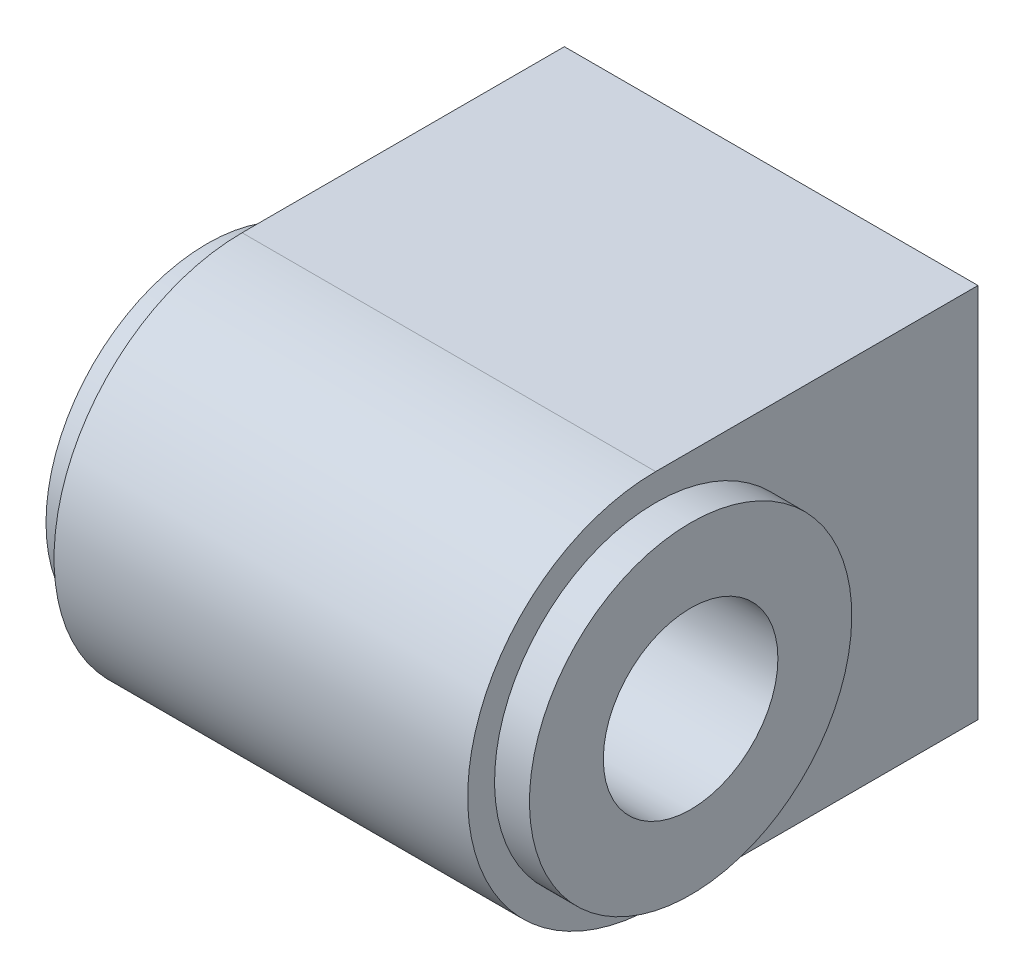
ISO-10303-21;
HEADER;
FILE_DESCRIPTION(('STEP AP214'),'2;1');
FILE_NAME('part.step','',(''),(''),'','','');
FILE_SCHEMA(('AUTOMOTIVE_DESIGN { 1 0 10303 214 1 1 1 1 }'));
ENDSEC;
DATA;
#1=APPLICATION_CONTEXT('core data for automotive mechanical design processes');
#2=APPLICATION_PROTOCOL_DEFINITION('international standard','automotive_design',2000,#1);
#3=PRODUCT_CONTEXT('',#1,'mechanical');
#4=PRODUCT('Part','Part','',(#3));
#5=PRODUCT_RELATED_PRODUCT_CATEGORY('part','',(#4));
#6=PRODUCT_DEFINITION_FORMATION('','',#4);
#7=PRODUCT_DEFINITION_CONTEXT('part definition',#1,'design');
#8=PRODUCT_DEFINITION('design','',#6,#7);
#9=PRODUCT_DEFINITION_SHAPE('','',#8);
#10=(LENGTH_UNIT() NAMED_UNIT(*) SI_UNIT(.MILLI.,.METRE.));
#11=(NAMED_UNIT(*) PLANE_ANGLE_UNIT() SI_UNIT($,.RADIAN.));
#12=(NAMED_UNIT(*) SI_UNIT($,.STERADIAN.) SOLID_ANGLE_UNIT());
#13=UNCERTAINTY_MEASURE_WITH_UNIT(LENGTH_MEASURE(1.E-05),#10,'distance_accuracy_value','');
#14=(GEOMETRIC_REPRESENTATION_CONTEXT(3) GLOBAL_UNCERTAINTY_ASSIGNED_CONTEXT((#13)) GLOBAL_UNIT_ASSIGNED_CONTEXT((#10,
#11,#12)) REPRESENTATION_CONTEXT('',''));
#15=CARTESIAN_POINT('',(0.,0.,0.));
#16=DIRECTION('',(0.,0.,1.));
#17=DIRECTION('',(1.,0.,0.));
#18=AXIS2_PLACEMENT_3D('',#15,#16,#17);
#19=CARTESIAN_POINT('',(7.7,0.,12.));
#20=DIRECTION('',(1.,0.,0.));
#21=DIRECTION('',(0.,1.,0.));
#22=AXIS2_PLACEMENT_3D('',#19,#20,#21);
#23=PLANE('',#22);
#24=DIRECTION('',(0.,1.,0.));
#25=VECTOR('',#24,1.);
#26=CARTESIAN_POINT('',(7.7,-7.,0.));
#27=LINE('',#26,#25);
#28=CARTESIAN_POINT('',(7.7,-7.,0.));
#29=VERTEX_POINT('',#28);
#30=CARTESIAN_POINT('',(7.7,7.,0.));
#31=VERTEX_POINT('',#30);
#32=EDGE_CURVE('E82',#29,#31,#27,.T.);
#33=ORIENTED_EDGE('',*,*,#32,.T.);
#34=DIRECTION('',(0.,0.,-1.));
#35=VECTOR('',#34,1.);
#36=CARTESIAN_POINT('',(7.7,7.,12.));
#37=LINE('',#36,#35);
#38=CARTESIAN_POINT('',(7.7,7.,12.));
#39=VERTEX_POINT('',#38);
#40=EDGE_CURVE('E62',#39,#31,#37,.T.);
#41=ORIENTED_EDGE('',*,*,#40,.F.);
#42=CARTESIAN_POINT('',(7.7,0.,12.));
#43=DIRECTION('',(1.,0.,0.));
#44=DIRECTION('',(0.,1.,0.));
#45=AXIS2_PLACEMENT_3D('',#42,#43,#44);
#46=CIRCLE('',#45,7.);
#47=CARTESIAN_POINT('',(7.7,-7.,12.));
#48=VERTEX_POINT('',#47);
#49=EDGE_CURVE('E85',#39,#48,#46,.T.);
#50=ORIENTED_EDGE('',*,*,#49,.T.);
#51=DIRECTION('',(0.,0.,-1.));
#52=VECTOR('',#51,1.);
#53=CARTESIAN_POINT('',(7.7,-7.,12.));
#54=LINE('',#53,#52);
#55=EDGE_CURVE('E87',#48,#29,#54,.T.);
#56=ORIENTED_EDGE('',*,*,#55,.T.);
#57=EDGE_LOOP('',(#33,#41,#50,#56));
#58=FACE_BOUND('',#57,.T.);
#59=CARTESIAN_POINT('',(7.7,0.,12.));
#60=DIRECTION('',(1.,0.,0.));
#61=DIRECTION('',(0.,1.,0.));
#62=AXIS2_PLACEMENT_3D('',#59,#60,#61);
#63=CIRCLE('',#62,6.);
#64=CARTESIAN_POINT('',(7.7,6.,12.));
#65=VERTEX_POINT('',#64);
#66=EDGE_CURVE('E166',#65,#65,#63,.T.);
#67=ORIENTED_EDGE('',*,*,#66,.F.);
#68=EDGE_LOOP('',(#67));
#69=FACE_BOUND('',#68,.T.);
#70=ADVANCED_FACE('F14',(#58,#69),#23,.T.);
#71=CARTESIAN_POINT('',(-7.7,0.,12.));
#72=DIRECTION('',(1.,0.,0.));
#73=DIRECTION('',(0.,1.,0.));
#74=AXIS2_PLACEMENT_3D('',#71,#72,#73);
#75=PLANE('',#74);
#76=DIRECTION('',(0.,1.,0.));
#77=VECTOR('',#76,1.);
#78=CARTESIAN_POINT('',(-7.7,-7.,0.));
#79=LINE('',#78,#77);
#80=CARTESIAN_POINT('',(-7.7,-7.,0.));
#81=VERTEX_POINT('',#80);
#82=CARTESIAN_POINT('',(-7.7,7.,0.));
#83=VERTEX_POINT('',#82);
#84=EDGE_CURVE('E67',#81,#83,#79,.T.);
#85=ORIENTED_EDGE('',*,*,#84,.F.);
#86=DIRECTION('',(0.,0.,-1.));
#87=VECTOR('',#86,1.);
#88=CARTESIAN_POINT('',(-7.7,-7.,12.));
#89=LINE('',#88,#87);
#90=CARTESIAN_POINT('',(-7.7,-7.,12.));
#91=VERTEX_POINT('',#90);
#92=EDGE_CURVE('E77',#91,#81,#89,.T.);
#93=ORIENTED_EDGE('',*,*,#92,.F.);
#94=CARTESIAN_POINT('',(-7.7,0.,12.));
#95=DIRECTION('',(1.,0.,0.));
#96=DIRECTION('',(0.,1.,0.));
#97=AXIS2_PLACEMENT_3D('',#94,#95,#96);
#98=CIRCLE('',#97,7.);
#99=CARTESIAN_POINT('',(-7.7,7.,12.));
#100=VERTEX_POINT('',#99);
#101=EDGE_CURVE('E75',#100,#91,#98,.T.);
#102=ORIENTED_EDGE('',*,*,#101,.F.);
#103=DIRECTION('',(0.,0.,-1.));
#104=VECTOR('',#103,1.);
#105=CARTESIAN_POINT('',(-7.7,7.,12.));
#106=LINE('',#105,#104);
#107=EDGE_CURVE('E59',#100,#83,#106,.T.);
#108=ORIENTED_EDGE('',*,*,#107,.T.);
#109=EDGE_LOOP('',(#85,#93,#102,#108));
#110=FACE_BOUND('',#109,.T.);
#111=CARTESIAN_POINT('',(-7.7,0.,12.));
#112=DIRECTION('',(1.,0.,0.));
#113=DIRECTION('',(0.,1.,0.));
#114=AXIS2_PLACEMENT_3D('',#111,#112,#113);
#115=CIRCLE('',#114,6.);
#116=CARTESIAN_POINT('',(-7.7,6.,12.));
#117=VERTEX_POINT('',#116);
#118=EDGE_CURVE('E9',#117,#117,#115,.F.);
#119=ORIENTED_EDGE('',*,*,#118,.F.);
#120=EDGE_LOOP('',(#119));
#121=FACE_BOUND('',#120,.T.);
#122=ADVANCED_FACE('F73',(#110,#121),#75,.F.);
#123=CARTESIAN_POINT('',(7.7,-7.,0.));
#124=DIRECTION('',(0.,0.,1.));
#125=DIRECTION('',(1.,0.,0.));
#126=AXIS2_PLACEMENT_3D('',#123,#124,#125);
#127=PLANE('',#126);
#128=CARTESIAN_POINT('',(0.,0.,0.));
#129=DIRECTION('',(0.,0.,-1.));
#130=DIRECTION('',(-1.,0.,0.));
#131=AXIS2_PLACEMENT_3D('',#128,#129,#130);
#132=CIRCLE('',#131,3.);
#133=CARTESIAN_POINT('',(-3.,0.,0.));
#134=VERTEX_POINT('',#133);
#135=EDGE_CURVE('E71',#134,#134,#132,.T.);
#136=ORIENTED_EDGE('',*,*,#135,.F.);
#137=EDGE_LOOP('',(#136));
#138=FACE_BOUND('',#137,.T.);
#139=DIRECTION('',(-1.,0.,0.));
#140=VECTOR('',#139,1.);
#141=CARTESIAN_POINT('',(7.7,7.,0.));
#142=LINE('',#141,#140);
#143=EDGE_CURVE('E22',#31,#83,#142,.T.);
#144=ORIENTED_EDGE('',*,*,#143,.F.);
#145=ORIENTED_EDGE('',*,*,#32,.F.);
#146=DIRECTION('',(-1.,0.,0.));
#147=VECTOR('',#146,1.);
#148=CARTESIAN_POINT('',(7.7,-7.,0.));
#149=LINE('',#148,#147);
#150=EDGE_CURVE('E29',#29,#81,#149,.T.);
#151=ORIENTED_EDGE('',*,*,#150,.T.);
#152=ORIENTED_EDGE('',*,*,#84,.T.);
#153=EDGE_LOOP('',(#144,#145,#151,#152));
#154=FACE_BOUND('',#153,.T.);
#155=ADVANCED_FACE('F68',(#138,#154),#127,.F.);
#156=CARTESIAN_POINT('',(7.7,7.,12.));
#157=DIRECTION('',(0.,1.,0.));
#158=DIRECTION('',(0.,0.,1.));
#159=AXIS2_PLACEMENT_3D('',#156,#157,#158);
#160=PLANE('',#159);
#161=DIRECTION('',(-1.,0.,0.));
#162=VECTOR('',#161,1.);
#163=CARTESIAN_POINT('',(7.7,7.,12.));
#164=LINE('',#163,#162);
#165=EDGE_CURVE('E65',#39,#100,#164,.T.);
#166=ORIENTED_EDGE('',*,*,#165,.F.);
#167=ORIENTED_EDGE('',*,*,#40,.T.);
#168=ORIENTED_EDGE('',*,*,#143,.T.);
#169=ORIENTED_EDGE('',*,*,#107,.F.);
#170=EDGE_LOOP('',(#166,#167,#168,#169));
#171=FACE_BOUND('',#170,.T.);
#172=ADVANCED_FACE('F16',(#171),#160,.T.);
#173=CARTESIAN_POINT('',(7.7,0.,12.));
#174=DIRECTION('',(-1.,0.,0.));
#175=DIRECTION('',(0.,-1.,0.));
#176=AXIS2_PLACEMENT_3D('',#173,#174,#175);
#177=CYLINDRICAL_SURFACE('',#176,7.);
#178=DIRECTION('',(-1.,0.,0.));
#179=VECTOR('',#178,1.);
#180=CARTESIAN_POINT('',(7.7,-7.,12.));
#181=LINE('',#180,#179);
#182=EDGE_CURVE('E37',#48,#91,#181,.T.);
#183=ORIENTED_EDGE('',*,*,#182,.F.);
#184=ORIENTED_EDGE('',*,*,#49,.F.);
#185=ORIENTED_EDGE('',*,*,#165,.T.);
#186=ORIENTED_EDGE('',*,*,#101,.T.);
#187=EDGE_LOOP('',(#183,#184,#185,#186));
#188=FACE_BOUND('',#187,.T.);
#189=ADVANCED_FACE('F92',(#188),#177,.T.);
#190=CARTESIAN_POINT('',(7.7,-7.,12.));
#191=DIRECTION('',(0.,1.,0.));
#192=DIRECTION('',(0.,0.,1.));
#193=AXIS2_PLACEMENT_3D('',#190,#191,#192);
#194=PLANE('',#193);
#195=ORIENTED_EDGE('',*,*,#55,.F.);
#196=ORIENTED_EDGE('',*,*,#182,.T.);
#197=ORIENTED_EDGE('',*,*,#92,.T.);
#198=ORIENTED_EDGE('',*,*,#150,.F.);
#199=EDGE_LOOP('',(#195,#196,#197,#198));
#200=FACE_BOUND('',#199,.T.);
#201=ADVANCED_FACE('F95',(#200),#194,.F.);
#202=CARTESIAN_POINT('',(0.,0.,12.));
#203=DIRECTION('',(0.,0.,-1.));
#204=DIRECTION('',(-1.,0.,0.));
#205=AXIS2_PLACEMENT_3D('',#202,#203,#204);
#206=CYLINDRICAL_SURFACE('',#205,3.);
#207=CARTESIAN_POINT('',(-3.,0.,8.75));
#208=CARTESIAN_POINT('',(-3.00000186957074,-0.0689412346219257,8.74999814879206));
#209=CARTESIAN_POINT('',(-2.99761875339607,-0.137864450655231,8.7521985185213));
#210=CARTESIAN_POINT('',(-2.98815158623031,-0.275116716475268,8.76093424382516));
#211=CARTESIAN_POINT('',(-2.98106641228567,-0.343445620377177,8.76747063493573));
#212=CARTESIAN_POINT('',(-2.95291668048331,-0.546758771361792,8.79341938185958));
#213=CARTESIAN_POINT('',(-2.92495789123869,-0.680077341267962,8.81917133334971));
#214=CARTESIAN_POINT('',(-2.85294556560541,-0.937275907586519,8.88526131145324));
#215=CARTESIAN_POINT('',(-2.80899796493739,-1.06121168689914,8.92550331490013));
#216=CARTESIAN_POINT('',(-2.70749381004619,-1.29851679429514,9.0179562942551));
#217=CARTESIAN_POINT('',(-2.64993220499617,-1.4118821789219,9.07017171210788));
#218=CARTESIAN_POINT('',(-2.49811128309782,-1.67035452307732,9.20687257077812));
#219=CARTESIAN_POINT('',(-2.39840894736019,-1.80985632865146,9.29588497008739));
#220=CARTESIAN_POINT('',(-2.18194351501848,-2.06575611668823,9.48591338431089));
#221=CARTESIAN_POINT('',(-2.06514058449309,-2.18209861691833,9.58695731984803));
#222=CARTESIAN_POINT('',(-1.87803004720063,-2.3409193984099,9.74426492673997));
#223=CARTESIAN_POINT('',(-1.81279689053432,-2.39176754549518,9.79835962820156));
#224=CARTESIAN_POINT('',(-1.67880000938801,-2.48765363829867,9.90731284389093));
#225=CARTESIAN_POINT('',(-1.61003707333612,-2.53269287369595,9.9621711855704));
#226=CARTESIAN_POINT('',(-1.4690643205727,-2.61698037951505,10.0716133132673));
#227=CARTESIAN_POINT('',(-1.39686017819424,-2.65623777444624,10.126197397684));
#228=CARTESIAN_POINT('',(-1.2486456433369,-2.72904763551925,10.2339260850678));
#229=CARTESIAN_POINT('',(-1.17263718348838,-2.76260296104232,10.2870713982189));
#230=CARTESIAN_POINT('',(-1.01836758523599,-2.82304859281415,10.3886994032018));
#231=CARTESIAN_POINT('',(-0.940228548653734,-2.85009879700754,10.4372708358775));
#232=CARTESIAN_POINT('',(-0.778824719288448,-2.89836672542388,10.5287311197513));
#233=CARTESIAN_POINT('',(-0.695559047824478,-2.91958344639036,10.571618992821));
#234=CARTESIAN_POINT('',(-0.536892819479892,-2.95249161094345,10.6411284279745));
#235=CARTESIAN_POINT('',(-0.462380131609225,-2.96516607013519,10.6692566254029));
#236=CARTESIAN_POINT('',(-0.309403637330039,-2.98498940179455,10.7143241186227));
#237=CARTESIAN_POINT('',(-0.230954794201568,-2.99215772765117,10.7313027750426));
#238=CARTESIAN_POINT('',(-0.0838051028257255,-2.99959247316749,10.748988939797));
#239=CARTESIAN_POINT('',(-0.015406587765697,-3.00073269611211,10.751754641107));
#240=CARTESIAN_POINT('',(0.120833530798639,-2.99834099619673,10.7460233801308));
#241=CARTESIAN_POINT('',(0.18867486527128,-2.99480693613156,10.7375212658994));
#242=CARTESIAN_POINT('',(0.343593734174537,-2.98157708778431,10.7065348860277));
#243=CARTESIAN_POINT('',(0.429773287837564,-2.97025451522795,10.6804099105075));
#244=CARTESIAN_POINT('',(0.596911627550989,-2.94125279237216,10.616983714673));
#245=CARTESIAN_POINT('',(0.677844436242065,-2.9235444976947,10.5796313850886));
#246=CARTESIAN_POINT('',(0.834650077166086,-2.88269011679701,10.4984446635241));
#247=CARTESIAN_POINT('',(0.910530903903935,-2.85955289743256,10.4546208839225));
#248=CARTESIAN_POINT('',(1.0582670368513,-2.80823632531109,10.363215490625));
#249=CARTESIAN_POINT('',(1.13011826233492,-2.78005197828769,10.3156301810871));
#250=CARTESIAN_POINT('',(1.27042131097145,-2.71880333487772,10.2184514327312));
#251=CARTESIAN_POINT('',(1.33886889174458,-2.68573314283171,10.1688556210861));
#252=CARTESIAN_POINT('',(1.4726358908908,-2.61478012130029,10.0688898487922));
#253=CARTESIAN_POINT('',(1.53795488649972,-2.57689664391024,10.0185197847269));
#254=CARTESIAN_POINT('',(1.67415598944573,-2.49088838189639,9.91114503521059));
#255=CARTESIAN_POINT('',(1.74461475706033,-2.44207153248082,9.85415341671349));
#256=CARTESIAN_POINT('',(1.88166041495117,-2.33810925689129,9.74131804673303));
#257=CARTESIAN_POINT('',(1.94824642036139,-2.28296239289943,9.68547455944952));
#258=CARTESIAN_POINT('',(2.14163914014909,-2.10797679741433,9.52120041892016));
#259=CARTESIAN_POINT('',(2.26247136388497,-1.9783491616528,9.41570953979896));
#260=CARTESIAN_POINT('',(2.45805318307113,-1.7254845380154,9.24264467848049));
#261=CARTESIAN_POINT('',(2.53700900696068,-1.60763921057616,9.17193111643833));
#262=CARTESIAN_POINT('',(2.67963240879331,-1.35658960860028,9.04331757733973));
#263=CARTESIAN_POINT('',(2.74331705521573,-1.22340273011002,8.98540330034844));
#264=CARTESIAN_POINT('',(2.84305827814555,-0.965884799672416,8.89433732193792));
#265=CARTESIAN_POINT('',(2.88189857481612,-0.843516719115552,8.8587117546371));
#266=CARTESIAN_POINT('',(2.94392756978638,-0.591666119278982,8.80171016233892));
#267=CARTESIAN_POINT('',(2.96712631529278,-0.462188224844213,8.78032499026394));
#268=CARTESIAN_POINT('',(2.99632008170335,-0.199103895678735,8.75340151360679));
#269=CARTESIAN_POINT('',(3.00224519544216,-0.065482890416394,8.74792760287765));
#270=CARTESIAN_POINT('',(2.99622408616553,0.201005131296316,8.75348534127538));
#271=CARTESIAN_POINT('',(2.98427790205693,0.333872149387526,8.76451695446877));
#272=CARTESIAN_POINT('',(2.94476530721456,0.586190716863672,8.80092377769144));
#273=CARTESIAN_POINT('',(2.91825659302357,0.705954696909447,8.82532747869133));
#274=CARTESIAN_POINT('',(2.85198911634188,0.938510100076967,8.88613250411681));
#275=CARTESIAN_POINT('',(2.81222599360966,1.0512992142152,8.92253777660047));
#276=CARTESIAN_POINT('',(2.70540769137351,1.30611396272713,9.01988577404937));
#277=CARTESIAN_POINT('',(2.6336708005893,1.44460229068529,9.08495781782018));
#278=CARTESIAN_POINT('',(2.47378265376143,1.70403544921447,9.22855988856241));
#279=CARTESIAN_POINT('',(2.38559671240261,1.82494222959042,9.30711832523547));
#280=CARTESIAN_POINT('',(2.16475433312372,2.0861568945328,9.50102213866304));
#281=CARTESIAN_POINT('',(2.02705303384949,2.2195828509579,9.61992269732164));
#282=CARTESIAN_POINT('',(1.80679799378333,2.39674099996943,9.8033211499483));
#283=CARTESIAN_POINT('',(1.73102398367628,2.45200158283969,9.86535133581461));
#284=CARTESIAN_POINT('',(1.57493068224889,2.55505980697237,9.98985237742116));
#285=CARTESIAN_POINT('',(1.49461328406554,2.6028605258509,10.0523230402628));
#286=CARTESIAN_POINT('',(1.30871055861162,2.70203648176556,10.1915618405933));
#287=CARTESIAN_POINT('',(1.20179212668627,2.75136725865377,10.2680410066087));
#288=CARTESIAN_POINT('',(1.03481381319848,2.81650592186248,10.3777729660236));
#289=CARTESIAN_POINT('',(0.978084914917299,2.83673448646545,10.4135021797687));
#290=CARTESIAN_POINT('',(0.862063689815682,2.8741194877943,10.4822834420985));
#291=CARTESIAN_POINT('',(0.802772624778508,2.89127741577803,10.5153367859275));
#292=CARTESIAN_POINT('',(0.67021766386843,2.92511584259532,10.5830073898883));
#293=CARTESIAN_POINT('',(0.596366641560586,2.941148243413,10.6168255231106));
#294=CARTESIAN_POINT('',(0.444211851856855,2.96792922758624,10.6752595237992));
#295=CARTESIAN_POINT('',(0.365919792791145,2.97869104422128,10.6998984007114));
#296=CARTESIAN_POINT('',(0.220062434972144,2.99264387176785,10.7323853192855));
#297=CARTESIAN_POINT('',(0.153112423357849,2.99685093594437,10.7424616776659));
#298=CARTESIAN_POINT('',(0.0183575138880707,3.00069840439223,10.7516648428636));
#299=CARTESIAN_POINT('',(-0.0494463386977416,3.00034393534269,10.7508039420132));
#300=CARTESIAN_POINT('',(-0.183604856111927,2.99512828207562,10.738356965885));
#301=CARTESIAN_POINT('',(-0.249963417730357,2.99028131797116,10.7268047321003));
#302=CARTESIAN_POINT('',(-0.380162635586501,2.97653870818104,10.6950062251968));
#303=CARTESIAN_POINT('',(-0.443997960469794,2.96763494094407,10.6747425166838));
#304=CARTESIAN_POINT('',(-0.565626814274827,2.94681064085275,10.6290869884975));
#305=CARTESIAN_POINT('',(-0.623563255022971,2.93505613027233,10.6039892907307));
#306=CARTESIAN_POINT('',(-0.736888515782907,2.9086730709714,10.5498151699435));
#307=CARTESIAN_POINT('',(-0.79227485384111,2.89404179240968,10.5207349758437));
#308=CARTESIAN_POINT('',(-0.955422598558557,2.84606612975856,10.429296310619));
#309=CARTESIAN_POINT('',(-1.05974776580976,2.8087169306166,10.3629211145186));
#310=CARTESIAN_POINT('',(-1.25347989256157,2.72744163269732,10.231058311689));
#311=CARTESIAN_POINT('',(-1.34341810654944,2.68423041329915,10.1658861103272));
#312=CARTESIAN_POINT('',(-1.5180395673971,2.58948364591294,10.0343849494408));
#313=CARTESIAN_POINT('',(-1.60271895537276,2.53794208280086,9.96805518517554));
#314=CARTESIAN_POINT('',(-1.76683008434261,2.42654573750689,9.83624932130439));
#315=CARTESIAN_POINT('',(-1.84627068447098,2.36670554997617,9.77077193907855));
#316=CARTESIAN_POINT('',(-1.99983393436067,2.23845234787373,9.64201531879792));
#317=CARTESIAN_POINT('',(-2.07395655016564,2.17003927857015,9.57873609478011));
#318=CARTESIAN_POINT('',(-2.24960988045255,1.99037444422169,9.42697330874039));
#319=CARTESIAN_POINT('',(-2.34778830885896,1.87403037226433,9.34050891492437));
#320=CARTESIAN_POINT('',(-2.5283174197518,1.6221951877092,9.17985542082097));
#321=CARTESIAN_POINT('',(-2.61069243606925,1.48673407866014,9.10564747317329));
#322=CARTESIAN_POINT('',(-2.74089107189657,1.2264895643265,8.98762699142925));
#323=CARTESIAN_POINT('',(-2.79232801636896,1.10493913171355,8.94070461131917));
#324=CARTESIAN_POINT('',(-2.8795531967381,0.852039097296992,8.86088942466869));
#325=CARTESIAN_POINT('',(-2.91536712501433,0.720706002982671,8.82797358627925));
#326=CARTESIAN_POINT('',(-2.96120088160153,0.490704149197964,8.78578809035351));
#327=CARTESIAN_POINT('',(-2.97569371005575,0.393648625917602,8.77242503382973));
#328=CARTESIAN_POINT('',(-2.99509244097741,0.197716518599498,8.75453184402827));
#329=CARTESIAN_POINT('',(-2.99999731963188,0.098839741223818,8.75000265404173));
#330=CARTESIAN_POINT('',(-3.,0.,8.75));
#331=B_SPLINE_CURVE_WITH_KNOTS('',3,(#207,#208,#209,#210,#211,#212,#213,#214,#215,#216,#217,
#218,#219,#220,#221,#222,#223,#224,#225,#226,#227,#228,#229,#230,#231,#232,#233,#234,#235,#236,
#237,#238,#239,#240,#241,#242,#243,#244,#245,#246,#247,#248,#249,#250,#251,#252,#253,#254,#255,
#256,#257,#258,#259,#260,#261,#262,#263,#264,#265,#266,#267,#268,#269,#270,#271,#272,#273,#274,
#275,#276,#277,#278,#279,#280,#281,#282,#283,#284,#285,#286,#287,#288,#289,#290,#291,#292,#293,
#294,#295,#296,#297,#298,#299,#300,#301,#302,#303,#304,#305,#306,#307,#308,#309,#310,#311,#312,
#313,#314,#315,#316,#317,#318,#319,#320,#321,#322,#323,#324,#325,#326,#327,#328,#329,#330),
.UNSPECIFIED.,.T.,.F.,(4,2,2,2,2,2,2,2,2,2,2,2,2,2,2,2,2,2,2,2,2,2,2,2,2,2,2,2,2,2,2,2,2,2,2,2,
2,2,2,2,2,2,2,2,2,2,2,2,2,2,2,2,2,2,2,2,2,2,2,2,2,4),(0.,0.206709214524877,0.413467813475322,
0.826961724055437,1.23776444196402,1.64871980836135,2.22518986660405,2.80302476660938,
3.09931979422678,3.39554892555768,3.69130544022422,3.98691320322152,4.2742695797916,
4.56167534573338,4.8028722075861,5.04321294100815,5.24751244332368,5.45190538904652,
5.72259430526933,5.99453461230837,6.26603382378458,6.53780319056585,6.80990321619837,
7.08203990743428,7.3905499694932,7.69913024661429,8.31462954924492,8.7885153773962,
9.26186905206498,9.65990369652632,10.0576824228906,10.4570687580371,10.8564542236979,
11.2300678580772,11.6038045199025,12.1079981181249,12.6132671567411,13.2862545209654,
13.6233344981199,13.9602750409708,14.3806261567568,14.5905873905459,14.8004463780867,
15.0482764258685,15.2954809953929,15.4980553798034,15.7004021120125,15.9021105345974,
16.104224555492,16.2966004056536,16.4891596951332,16.8756700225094,17.2328274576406,
17.5902439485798,17.9470396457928,18.3038376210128,18.827145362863,19.3496407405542,
19.7682388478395,20.1861459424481,20.4824693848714,20.7788244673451),.UNSPECIFIED.);
#332=CARTESIAN_POINT('',(-3.,0.,8.75));
#333=VERTEX_POINT('',#332);
#334=EDGE_CURVE('E125',#333,#333,#331,.T.);
#335=ORIENTED_EDGE('',*,*,#334,.T.);
#336=EDGE_LOOP('',(#335));
#337=FACE_BOUND('',#336,.T.);
#338=ORIENTED_EDGE('',*,*,#135,.T.);
#339=EDGE_LOOP('',(#338));
#340=FACE_BOUND('',#339,.T.);
#341=ADVANCED_FACE('F97',(#337,#340),#206,.F.);
#342=CARTESIAN_POINT('',(-9.,0.,12.));
#343=DIRECTION('',(1.,0.,0.));
#344=DIRECTION('',(0.,1.,0.));
#345=AXIS2_PLACEMENT_3D('',#342,#343,#344);
#346=CYLINDRICAL_SURFACE('',#345,3.25);
#347=ORIENTED_EDGE('',*,*,#334,.F.);
#348=EDGE_LOOP('',(#347));
#349=FACE_BOUND('',#348,.T.);
#350=CARTESIAN_POINT('',(-9.,0.,12.));
#351=DIRECTION('',(-1.,0.,0.));
#352=DIRECTION('',(0.,-1.,0.));
#353=AXIS2_PLACEMENT_3D('',#350,#351,#352);
#354=CIRCLE('',#353,3.25);
#355=CARTESIAN_POINT('',(-9.,-3.25,12.));
#356=VERTEX_POINT('',#355);
#357=EDGE_CURVE('E171',#356,#356,#354,.T.);
#358=ORIENTED_EDGE('',*,*,#357,.T.);
#359=EDGE_LOOP('',(#358));
#360=FACE_BOUND('',#359,.T.);
#361=CARTESIAN_POINT('',(9.,0.,12.));
#362=DIRECTION('',(1.,0.,0.));
#363=DIRECTION('',(0.,1.,0.));
#364=AXIS2_PLACEMENT_3D('',#361,#362,#363);
#365=CIRCLE('',#364,3.25);
#366=CARTESIAN_POINT('',(9.,3.25,12.));
#367=VERTEX_POINT('',#366);
#368=EDGE_CURVE('E164',#367,#367,#365,.T.);
#369=ORIENTED_EDGE('',*,*,#368,.T.);
#370=EDGE_LOOP('',(#369));
#371=FACE_BOUND('',#370,.T.);
#372=ADVANCED_FACE('F105',(#349,#360,#371),#346,.F.);
#373=CARTESIAN_POINT('',(-9.,0.,12.));
#374=DIRECTION('',(-1.,0.,0.));
#375=DIRECTION('',(0.,-1.,0.));
#376=AXIS2_PLACEMENT_3D('',#373,#374,#375);
#377=PLANE('',#376);
#378=CARTESIAN_POINT('',(-9.,0.,12.));
#379=DIRECTION('',(-1.,0.,0.));
#380=DIRECTION('',(0.,-1.,0.));
#381=AXIS2_PLACEMENT_3D('',#378,#379,#380);
#382=CIRCLE('',#381,6.);
#383=CARTESIAN_POINT('',(-9.,-6.,12.));
#384=VERTEX_POINT('',#383);
#385=EDGE_CURVE('E127',#384,#384,#382,.T.);
#386=ORIENTED_EDGE('',*,*,#385,.T.);
#387=EDGE_LOOP('',(#386));
#388=FACE_BOUND('',#387,.T.);
#389=ORIENTED_EDGE('',*,*,#357,.F.);
#390=EDGE_LOOP('',(#389));
#391=FACE_BOUND('',#390,.T.);
#392=ADVANCED_FACE('F139',(#388,#391),#377,.T.);
#393=CARTESIAN_POINT('',(-9.,0.,12.));
#394=DIRECTION('',(1.,0.,0.));
#395=DIRECTION('',(0.,1.,0.));
#396=AXIS2_PLACEMENT_3D('',#393,#394,#395);
#397=CYLINDRICAL_SURFACE('',#396,6.);
#398=ORIENTED_EDGE('',*,*,#385,.F.);
#399=EDGE_LOOP('',(#398));
#400=FACE_BOUND('',#399,.T.);
#401=ORIENTED_EDGE('',*,*,#118,.T.);
#402=EDGE_LOOP('',(#401));
#403=FACE_BOUND('',#402,.T.);
#404=ADVANCED_FACE('F141',(#400,#403),#397,.T.);
#405=CARTESIAN_POINT('',(9.,0.,12.));
#406=DIRECTION('',(1.,0.,0.));
#407=DIRECTION('',(0.,1.,0.));
#408=AXIS2_PLACEMENT_3D('',#405,#406,#407);
#409=PLANE('',#408);
#410=CARTESIAN_POINT('',(9.,0.,12.));
#411=DIRECTION('',(1.,0.,0.));
#412=DIRECTION('',(0.,1.,0.));
#413=AXIS2_PLACEMENT_3D('',#410,#411,#412);
#414=CIRCLE('',#413,6.);
#415=CARTESIAN_POINT('',(9.,6.,12.));
#416=VERTEX_POINT('',#415);
#417=EDGE_CURVE('E161',#416,#416,#414,.T.);
#418=ORIENTED_EDGE('',*,*,#417,.T.);
#419=EDGE_LOOP('',(#418));
#420=FACE_BOUND('',#419,.T.);
#421=ORIENTED_EDGE('',*,*,#368,.F.);
#422=EDGE_LOOP('',(#421));
#423=FACE_BOUND('',#422,.T.);
#424=ADVANCED_FACE('F144',(#420,#423),#409,.T.);
#425=CARTESIAN_POINT('',(9.,0.,12.));
#426=DIRECTION('',(-1.,0.,0.));
#427=DIRECTION('',(0.,-1.,0.));
#428=AXIS2_PLACEMENT_3D('',#425,#426,#427);
#429=CYLINDRICAL_SURFACE('',#428,6.);
#430=ORIENTED_EDGE('',*,*,#417,.F.);
#431=EDGE_LOOP('',(#430));
#432=FACE_BOUND('',#431,.T.);
#433=ORIENTED_EDGE('',*,*,#66,.T.);
#434=EDGE_LOOP('',(#433));
#435=FACE_BOUND('',#434,.T.);
#436=ADVANCED_FACE('F149',(#432,#435),#429,.T.);
#437=CLOSED_SHELL('',(#70,#122,#155,#172,#189,#201,#341,#372,#392,#404,#424,#436));
#438=MANIFOLD_SOLID_BREP('B1',#437);
#439=ADVANCED_BREP_SHAPE_REPRESENTATION('',(#18,#438),#14);
#440=SHAPE_DEFINITION_REPRESENTATION(#9,#439);
ENDSEC;
END-ISO-10303-21;
